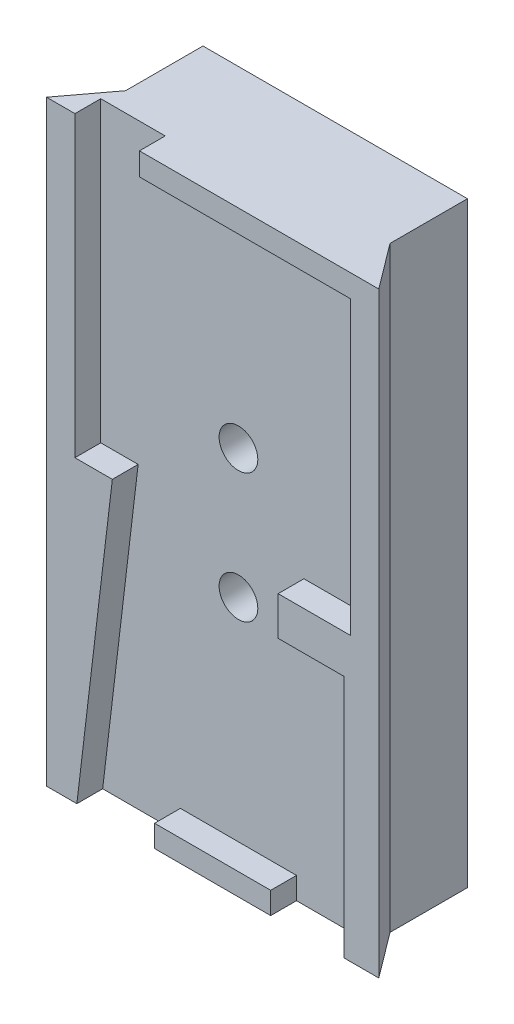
ISO-10303-21;
HEADER;
FILE_DESCRIPTION(('STEP AP214'),'2;1');
FILE_NAME('part.step','',(''),(''),'','','');
FILE_SCHEMA(('AUTOMOTIVE_DESIGN { 1 0 10303 214 1 1 1 1 }'));
ENDSEC;
DATA;
#1=APPLICATION_CONTEXT('core data for automotive mechanical design processes');
#2=APPLICATION_PROTOCOL_DEFINITION('international standard','automotive_design',2000,#1);
#3=PRODUCT_CONTEXT('',#1,'mechanical');
#4=PRODUCT('Part','Part','',(#3));
#5=PRODUCT_RELATED_PRODUCT_CATEGORY('part','',(#4));
#6=PRODUCT_DEFINITION_FORMATION('','',#4);
#7=PRODUCT_DEFINITION_CONTEXT('part definition',#1,'design');
#8=PRODUCT_DEFINITION('design','',#6,#7);
#9=PRODUCT_DEFINITION_SHAPE('','',#8);
#10=(LENGTH_UNIT() NAMED_UNIT(*) SI_UNIT(.MILLI.,.METRE.));
#11=(NAMED_UNIT(*) PLANE_ANGLE_UNIT() SI_UNIT($,.RADIAN.));
#12=(NAMED_UNIT(*) SI_UNIT($,.STERADIAN.) SOLID_ANGLE_UNIT());
#13=UNCERTAINTY_MEASURE_WITH_UNIT(LENGTH_MEASURE(1.E-05),#10,'distance_accuracy_value','');
#14=(GEOMETRIC_REPRESENTATION_CONTEXT(3) GLOBAL_UNCERTAINTY_ASSIGNED_CONTEXT((#13)) GLOBAL_UNIT_ASSIGNED_CONTEXT((#10,
#11,#12)) REPRESENTATION_CONTEXT('',''));
#15=CARTESIAN_POINT('',(0.,0.,0.));
#16=DIRECTION('',(0.,0.,1.));
#17=DIRECTION('',(1.,0.,0.));
#18=AXIS2_PLACEMENT_3D('',#15,#16,#17);
#19=CARTESIAN_POINT('',(25.75,92.5,19.));
#20=DIRECTION('',(0.,0.,-1.));
#21=DIRECTION('',(-1.,0.,0.));
#22=AXIS2_PLACEMENT_3D('',#19,#20,#21);
#23=PLANE('',#22);
#24=DIRECTION('',(1.,0.,0.));
#25=VECTOR('',#24,1.);
#26=CARTESIAN_POINT('',(25.75,0.,19.));
#27=LINE('',#26,#25);
#28=CARTESIAN_POINT('',(-25.75,0.,19.));
#29=VERTEX_POINT('',#28);
#30=CARTESIAN_POINT('',(-21.05,0.,19.));
#31=VERTEX_POINT('',#30);
#32=EDGE_CURVE('E149',#29,#31,#27,.T.);
#33=ORIENTED_EDGE('',*,*,#32,.T.);
#34=DIRECTION('',(-0.11796112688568,-0.993018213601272,0.));
#35=VECTOR('',#34,1.);
#36=CARTESIAN_POINT('',(-21.05,0.,19.));
#37=LINE('',#36,#35);
#38=CARTESIAN_POINT('',(-15.55,46.3,19.));
#39=VERTEX_POINT('',#38);
#40=EDGE_CURVE('E169',#39,#31,#37,.T.);
#41=ORIENTED_EDGE('',*,*,#40,.F.);
#42=DIRECTION('',(1.,0.,0.));
#43=VECTOR('',#42,1.);
#44=CARTESIAN_POINT('',(-15.55,46.3,19.));
#45=LINE('',#44,#43);
#46=CARTESIAN_POINT('',(-21.35,46.3,19.));
#47=VERTEX_POINT('',#46);
#48=EDGE_CURVE('E348',#47,#39,#45,.T.);
#49=ORIENTED_EDGE('',*,*,#48,.F.);
#50=DIRECTION('',(0.,-1.,0.));
#51=VECTOR('',#50,1.);
#52=CARTESIAN_POINT('',(-21.35,46.3,19.));
#53=LINE('',#52,#51);
#54=CARTESIAN_POINT('',(-21.35,92.5,19.));
#55=VERTEX_POINT('',#54);
#56=EDGE_CURVE('E133',#55,#47,#53,.T.);
#57=ORIENTED_EDGE('',*,*,#56,.F.);
#58=DIRECTION('',(1.,0.,0.));
#59=VECTOR('',#58,1.);
#60=CARTESIAN_POINT('',(25.75,92.5,19.));
#61=LINE('',#60,#59);
#62=CARTESIAN_POINT('',(-25.75,92.5,19.));
#63=VERTEX_POINT('',#62);
#64=EDGE_CURVE('E111',#63,#55,#61,.T.);
#65=ORIENTED_EDGE('',*,*,#64,.F.);
#66=DIRECTION('',(0.,-1.,0.));
#67=VECTOR('',#66,1.);
#68=CARTESIAN_POINT('',(-25.75,92.5,19.));
#69=LINE('',#68,#67);
#70=EDGE_CURVE('E120',#63,#29,#69,.T.);
#71=ORIENTED_EDGE('',*,*,#70,.T.);
#72=EDGE_LOOP('',(#33,#41,#49,#57,#65,#71));
#73=FACE_BOUND('',#72,.T.);
#74=ADVANCED_FACE('F35',(#73),#23,.F.);
#75=CARTESIAN_POINT('',(-11.35,92.5,19.));
#76=VERTEX_POINT('',#75);
#77=CARTESIAN_POINT('',(25.75,92.5,19.));
#78=VERTEX_POINT('',#77);
#79=EDGE_CURVE('E117',#76,#78,#61,.T.);
#80=ORIENTED_EDGE('',*,*,#79,.F.);
#81=DIRECTION('',(0.,1.,0.));
#82=VECTOR('',#81,1.);
#83=CARTESIAN_POINT('',(-11.35,92.5,19.));
#84=LINE('',#83,#82);
#85=CARTESIAN_POINT('',(-11.35,89.,19.));
#86=VERTEX_POINT('',#85);
#87=EDGE_CURVE('E345',#86,#76,#84,.T.);
#88=ORIENTED_EDGE('',*,*,#87,.F.);
#89=DIRECTION('',(-1.,0.,0.));
#90=VECTOR('',#89,1.);
#91=CARTESIAN_POINT('',(-11.35,89.,19.));
#92=LINE('',#91,#90);
#93=CARTESIAN_POINT('',(21.35,89.,19.));
#94=VERTEX_POINT('',#93);
#95=EDGE_CURVE('E342',#94,#86,#92,.T.);
#96=ORIENTED_EDGE('',*,*,#95,.F.);
#97=DIRECTION('',(0.,1.,0.));
#98=VECTOR('',#97,1.);
#99=CARTESIAN_POINT('',(21.35,89.,19.));
#100=LINE('',#99,#98);
#101=CARTESIAN_POINT('',(21.35,43.8,19.));
#102=VERTEX_POINT('',#101);
#103=EDGE_CURVE('E339',#102,#94,#100,.T.);
#104=ORIENTED_EDGE('',*,*,#103,.F.);
#105=DIRECTION('',(1.,0.,0.));
#106=VECTOR('',#105,1.);
#107=CARTESIAN_POINT('',(21.35,43.8,19.));
#108=LINE('',#107,#106);
#109=CARTESIAN_POINT('',(10.15,43.8,19.));
#110=VERTEX_POINT('',#109);
#111=EDGE_CURVE('E336',#110,#102,#108,.T.);
#112=ORIENTED_EDGE('',*,*,#111,.F.);
#113=DIRECTION('',(0.,1.,0.));
#114=VECTOR('',#113,1.);
#115=CARTESIAN_POINT('',(10.15,43.8,19.));
#116=LINE('',#115,#114);
#117=CARTESIAN_POINT('',(10.15,37.8,19.));
#118=VERTEX_POINT('',#117);
#119=EDGE_CURVE('E333',#118,#110,#116,.T.);
#120=ORIENTED_EDGE('',*,*,#119,.F.);
#121=DIRECTION('',(-1.,0.,0.));
#122=VECTOR('',#121,1.);
#123=CARTESIAN_POINT('',(10.15,37.8,19.));
#124=LINE('',#123,#122);
#125=CARTESIAN_POINT('',(20.35,37.8,19.));
#126=VERTEX_POINT('',#125);
#127=EDGE_CURVE('E330',#126,#118,#124,.T.);
#128=ORIENTED_EDGE('',*,*,#127,.F.);
#129=DIRECTION('',(0.,1.,0.));
#130=VECTOR('',#129,1.);
#131=CARTESIAN_POINT('',(20.35,37.8,19.));
#132=LINE('',#131,#130);
#133=CARTESIAN_POINT('',(20.35,0.,19.));
#134=VERTEX_POINT('',#133);
#135=EDGE_CURVE('E327',#134,#126,#132,.T.);
#136=ORIENTED_EDGE('',*,*,#135,.F.);
#137=CARTESIAN_POINT('',(25.75,0.,19.));
#138=VERTEX_POINT('',#137);
#139=EDGE_CURVE('E148',#134,#138,#27,.T.);
#140=ORIENTED_EDGE('',*,*,#139,.T.);
#141=DIRECTION('',(0.,-1.,0.));
#142=VECTOR('',#141,1.);
#143=CARTESIAN_POINT('',(25.75,92.5,19.));
#144=LINE('',#143,#142);
#145=EDGE_CURVE('E128',#78,#138,#144,.T.);
#146=ORIENTED_EDGE('',*,*,#145,.F.);
#147=EDGE_LOOP('',(#80,#88,#96,#104,#112,#120,#128,#136,#140,#146));
#148=FACE_BOUND('',#147,.T.);
#149=ADVANCED_FACE('F391',(#148),#23,.F.);
#150=CARTESIAN_POINT('',(20.5,92.5,0.));
#151=DIRECTION('',(-1.,0.,0.));
#152=DIRECTION('',(0.,0.,1.));
#153=AXIS2_PLACEMENT_3D('',#150,#151,#152);
#154=PLANE('',#153);
#155=DIRECTION('',(0.,0.,-1.));
#156=VECTOR('',#155,1.);
#157=CARTESIAN_POINT('',(20.5,0.,0.));
#158=LINE('',#157,#156);
#159=CARTESIAN_POINT('',(20.5,0.,12.));
#160=VERTEX_POINT('',#159);
#161=CARTESIAN_POINT('',(20.5,0.,0.));
#162=VERTEX_POINT('',#161);
#163=EDGE_CURVE('E139',#160,#162,#158,.T.);
#164=ORIENTED_EDGE('',*,*,#163,.T.);
#165=DIRECTION('',(0.,-1.,0.));
#166=VECTOR('',#165,1.);
#167=CARTESIAN_POINT('',(20.5,92.5,0.));
#168=LINE('',#167,#166);
#169=CARTESIAN_POINT('',(20.5,92.5,0.));
#170=VERTEX_POINT('',#169);
#171=EDGE_CURVE('E11',#170,#162,#168,.T.);
#172=ORIENTED_EDGE('',*,*,#171,.F.);
#173=DIRECTION('',(0.,0.,-1.));
#174=VECTOR('',#173,1.);
#175=CARTESIAN_POINT('',(20.5,92.5,0.));
#176=LINE('',#175,#174);
#177=CARTESIAN_POINT('',(20.5,92.5,12.));
#178=VERTEX_POINT('',#177);
#179=EDGE_CURVE('E153',#178,#170,#176,.T.);
#180=ORIENTED_EDGE('',*,*,#179,.F.);
#181=DIRECTION('',(0.,-1.,0.));
#182=VECTOR('',#181,1.);
#183=CARTESIAN_POINT('',(20.5,92.5,12.));
#184=LINE('',#183,#182);
#185=EDGE_CURVE('E135',#178,#160,#184,.T.);
#186=ORIENTED_EDGE('',*,*,#185,.T.);
#187=EDGE_LOOP('',(#164,#172,#180,#186));
#188=FACE_BOUND('',#187,.T.);
#189=ADVANCED_FACE('F37',(#188),#154,.F.);
#190=CARTESIAN_POINT('',(-20.5,92.5,0.));
#191=DIRECTION('',(0.,0.,1.));
#192=DIRECTION('',(1.,0.,0.));
#193=AXIS2_PLACEMENT_3D('',#190,#191,#192);
#194=PLANE('',#193);
#195=CARTESIAN_POINT('',(0.,56.25,0.));
#196=DIRECTION('',(0.,0.,1.));
#197=DIRECTION('',(1.,0.,0.));
#198=AXIS2_PLACEMENT_3D('',#195,#196,#197);
#199=CIRCLE('',#198,3.);
#200=CARTESIAN_POINT('',(3.,56.25,0.));
#201=VERTEX_POINT('',#200);
#202=EDGE_CURVE('E323',#201,#201,#199,.T.);
#203=ORIENTED_EDGE('',*,*,#202,.T.);
#204=EDGE_LOOP('',(#203));
#205=FACE_BOUND('',#204,.T.);
#206=CARTESIAN_POINT('',(0.,36.25,0.));
#207=DIRECTION('',(0.,0.,1.));
#208=DIRECTION('',(-1.,0.,0.));
#209=AXIS2_PLACEMENT_3D('',#206,#207,#208);
#210=CIRCLE('',#209,3.);
#211=CARTESIAN_POINT('',(3.,36.25,0.));
#212=VERTEX_POINT('',#211);
#213=EDGE_CURVE('E616',#212,#212,#210,.T.);
#214=ORIENTED_EDGE('',*,*,#213,.T.);
#215=EDGE_LOOP('',(#214));
#216=FACE_BOUND('',#215,.T.);
#217=DIRECTION('',(-1.,0.,0.));
#218=VECTOR('',#217,1.);
#219=CARTESIAN_POINT('',(-20.5,0.,0.));
#220=LINE('',#219,#218);
#221=CARTESIAN_POINT('',(-20.5,0.,0.));
#222=VERTEX_POINT('',#221);
#223=EDGE_CURVE('E142',#162,#222,#220,.T.);
#224=ORIENTED_EDGE('',*,*,#223,.T.);
#225=DIRECTION('',(0.,-1.,0.));
#226=VECTOR('',#225,1.);
#227=CARTESIAN_POINT('',(-20.5,92.5,0.));
#228=LINE('',#227,#226);
#229=CARTESIAN_POINT('',(-20.5,92.5,0.));
#230=VERTEX_POINT('',#229);
#231=EDGE_CURVE('E43',#230,#222,#228,.T.);
#232=ORIENTED_EDGE('',*,*,#231,.F.);
#233=DIRECTION('',(-1.,0.,0.));
#234=VECTOR('',#233,1.);
#235=CARTESIAN_POINT('',(-20.5,92.5,0.));
#236=LINE('',#235,#234);
#237=EDGE_CURVE('E94',#170,#230,#236,.T.);
#238=ORIENTED_EDGE('',*,*,#237,.F.);
#239=ORIENTED_EDGE('',*,*,#171,.T.);
#240=EDGE_LOOP('',(#224,#232,#238,#239));
#241=FACE_BOUND('',#240,.T.);
#242=ADVANCED_FACE('F383',(#205,#216,#241),#194,.F.);
#243=CARTESIAN_POINT('',(-20.5,92.5,0.));
#244=DIRECTION('',(1.,0.,0.));
#245=DIRECTION('',(0.,0.,-1.));
#246=AXIS2_PLACEMENT_3D('',#243,#244,#245);
#247=PLANE('',#246);
#248=DIRECTION('',(0.,0.,1.));
#249=VECTOR('',#248,1.);
#250=CARTESIAN_POINT('',(-20.5,0.,0.));
#251=LINE('',#250,#249);
#252=CARTESIAN_POINT('',(-20.5,0.,12.));
#253=VERTEX_POINT('',#252);
#254=EDGE_CURVE('E145',#222,#253,#251,.T.);
#255=ORIENTED_EDGE('',*,*,#254,.T.);
#256=DIRECTION('',(0.,-1.,0.));
#257=VECTOR('',#256,1.);
#258=CARTESIAN_POINT('',(-20.5,92.5,12.));
#259=LINE('',#258,#257);
#260=CARTESIAN_POINT('',(-20.5,92.5,12.));
#261=VERTEX_POINT('',#260);
#262=EDGE_CURVE('E127',#261,#253,#259,.T.);
#263=ORIENTED_EDGE('',*,*,#262,.F.);
#264=DIRECTION('',(0.,0.,1.));
#265=VECTOR('',#264,1.);
#266=CARTESIAN_POINT('',(-20.5,92.5,0.));
#267=LINE('',#266,#265);
#268=EDGE_CURVE('E113',#230,#261,#267,.T.);
#269=ORIENTED_EDGE('',*,*,#268,.F.);
#270=ORIENTED_EDGE('',*,*,#231,.T.);
#271=EDGE_LOOP('',(#255,#263,#269,#270));
#272=FACE_BOUND('',#271,.T.);
#273=ADVANCED_FACE('F159',(#272),#247,.F.);
#274=CARTESIAN_POINT('',(-20.5,92.5,12.));
#275=DIRECTION('',(0.8,0.,0.6));
#276=DIRECTION('',(0.6,0.,-0.8));
#277=AXIS2_PLACEMENT_3D('',#274,#275,#276);
#278=PLANE('',#277);
#279=DIRECTION('',(-0.6,0.,0.8));
#280=VECTOR('',#279,1.);
#281=CARTESIAN_POINT('',(-20.5,0.,12.));
#282=LINE('',#281,#280);
#283=EDGE_CURVE('E123',#253,#29,#282,.T.);
#284=ORIENTED_EDGE('',*,*,#283,.T.);
#285=ORIENTED_EDGE('',*,*,#70,.F.);
#286=DIRECTION('',(-0.6,0.,0.8));
#287=VECTOR('',#286,1.);
#288=CARTESIAN_POINT('',(-20.5,92.5,12.));
#289=LINE('',#288,#287);
#290=EDGE_CURVE('E105',#261,#63,#289,.T.);
#291=ORIENTED_EDGE('',*,*,#290,.F.);
#292=ORIENTED_EDGE('',*,*,#262,.T.);
#293=EDGE_LOOP('',(#284,#285,#291,#292));
#294=FACE_BOUND('',#293,.T.);
#295=ADVANCED_FACE('F121',(#294),#278,.F.);
#296=CARTESIAN_POINT('',(-9.,0.,19.));
#297=VERTEX_POINT('',#296);
#298=CARTESIAN_POINT('',(9.,0.,19.));
#299=VERTEX_POINT('',#298);
#300=EDGE_CURVE('E151',#297,#299,#27,.T.);
#301=ORIENTED_EDGE('',*,*,#300,.T.);
#302=DIRECTION('',(0.,-1.,0.));
#303=VECTOR('',#302,1.);
#304=CARTESIAN_POINT('',(9.,0.,19.));
#305=LINE('',#304,#303);
#306=CARTESIAN_POINT('',(9.,3.4,19.));
#307=VERTEX_POINT('',#306);
#308=EDGE_CURVE('E325',#307,#299,#305,.T.);
#309=ORIENTED_EDGE('',*,*,#308,.F.);
#310=DIRECTION('',(1.,0.,0.));
#311=VECTOR('',#310,1.);
#312=CARTESIAN_POINT('',(9.,3.4,19.));
#313=LINE('',#312,#311);
#314=CARTESIAN_POINT('',(-9.,3.4,19.));
#315=VERTEX_POINT('',#314);
#316=EDGE_CURVE('E322',#315,#307,#313,.T.);
#317=ORIENTED_EDGE('',*,*,#316,.F.);
#318=DIRECTION('',(0.,1.,0.));
#319=VECTOR('',#318,1.);
#320=CARTESIAN_POINT('',(-9.,3.4,19.));
#321=LINE('',#320,#319);
#322=EDGE_CURVE('E268',#297,#315,#321,.T.);
#323=ORIENTED_EDGE('',*,*,#322,.F.);
#324=EDGE_LOOP('',(#301,#309,#317,#323));
#325=FACE_BOUND('',#324,.T.);
#326=ADVANCED_FACE('F396',(#325),#23,.F.);
#327=CARTESIAN_POINT('',(20.5,92.5,12.));
#328=DIRECTION('',(-0.8,0.,0.6));
#329=DIRECTION('',(0.600000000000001,0.,0.8));
#330=AXIS2_PLACEMENT_3D('',#327,#328,#329);
#331=PLANE('',#330);
#332=DIRECTION('',(-0.6,0.,-0.8));
#333=VECTOR('',#332,1.);
#334=CARTESIAN_POINT('',(20.5,0.,12.));
#335=LINE('',#334,#333);
#336=EDGE_CURVE('E86',#138,#160,#335,.T.);
#337=ORIENTED_EDGE('',*,*,#336,.T.);
#338=ORIENTED_EDGE('',*,*,#185,.F.);
#339=DIRECTION('',(-0.6,0.,-0.8));
#340=VECTOR('',#339,1.);
#341=CARTESIAN_POINT('',(20.5,92.5,12.));
#342=LINE('',#341,#340);
#343=EDGE_CURVE('E59',#78,#178,#342,.T.);
#344=ORIENTED_EDGE('',*,*,#343,.F.);
#345=ORIENTED_EDGE('',*,*,#145,.T.);
#346=EDGE_LOOP('',(#337,#338,#344,#345));
#347=FACE_BOUND('',#346,.T.);
#348=ADVANCED_FACE('F404',(#347),#331,.F.);
#349=CARTESIAN_POINT('',(0.,92.5,0.));
#350=DIRECTION('',(0.,-1.,0.));
#351=DIRECTION('',(0.,0.,-1.));
#352=AXIS2_PLACEMENT_3D('',#349,#350,#351);
#353=PLANE('',#352);
#354=ORIENTED_EDGE('',*,*,#64,.T.);
#355=DIRECTION('',(0.,0.,1.));
#356=VECTOR('',#355,1.);
#357=CARTESIAN_POINT('',(-21.35,92.5,15.));
#358=LINE('',#357,#356);
#359=CARTESIAN_POINT('',(-21.35,92.5,15.));
#360=VERTEX_POINT('',#359);
#361=EDGE_CURVE('E355',#360,#55,#358,.T.);
#362=ORIENTED_EDGE('',*,*,#361,.F.);
#363=DIRECTION('',(-1.,0.,0.));
#364=VECTOR('',#363,1.);
#365=CARTESIAN_POINT('',(-21.35,92.5,15.));
#366=LINE('',#365,#364);
#367=CARTESIAN_POINT('',(-11.35,92.5,15.));
#368=VERTEX_POINT('',#367);
#369=EDGE_CURVE('E310',#368,#360,#366,.T.);
#370=ORIENTED_EDGE('',*,*,#369,.F.);
#371=DIRECTION('',(0.,0.,1.));
#372=VECTOR('',#371,1.);
#373=CARTESIAN_POINT('',(-11.35,92.5,15.));
#374=LINE('',#373,#372);
#375=EDGE_CURVE('E357',#368,#76,#374,.T.);
#376=ORIENTED_EDGE('',*,*,#375,.T.);
#377=ORIENTED_EDGE('',*,*,#79,.T.);
#378=ORIENTED_EDGE('',*,*,#343,.T.);
#379=ORIENTED_EDGE('',*,*,#179,.T.);
#380=ORIENTED_EDGE('',*,*,#237,.T.);
#381=ORIENTED_EDGE('',*,*,#268,.T.);
#382=ORIENTED_EDGE('',*,*,#290,.T.);
#383=EDGE_LOOP('',(#354,#362,#370,#376,#377,#378,#379,#380,#381,#382));
#384=FACE_BOUND('',#383,.T.);
#385=ADVANCED_FACE('F107',(#384),#353,.F.);
#386=CARTESIAN_POINT('',(0.,0.,0.));
#387=DIRECTION('',(0.,-1.,0.));
#388=DIRECTION('',(0.,0.,-1.));
#389=AXIS2_PLACEMENT_3D('',#386,#387,#388);
#390=PLANE('',#389);
#391=DIRECTION('',(0.,0.,1.));
#392=VECTOR('',#391,1.);
#393=CARTESIAN_POINT('',(-21.05,0.,15.));
#394=LINE('',#393,#392);
#395=CARTESIAN_POINT('',(-21.05,0.,15.));
#396=VERTEX_POINT('',#395);
#397=EDGE_CURVE('E143',#396,#31,#394,.T.);
#398=ORIENTED_EDGE('',*,*,#397,.T.);
#399=ORIENTED_EDGE('',*,*,#32,.F.);
#400=ORIENTED_EDGE('',*,*,#283,.F.);
#401=ORIENTED_EDGE('',*,*,#254,.F.);
#402=ORIENTED_EDGE('',*,*,#223,.F.);
#403=ORIENTED_EDGE('',*,*,#163,.F.);
#404=ORIENTED_EDGE('',*,*,#336,.F.);
#405=ORIENTED_EDGE('',*,*,#139,.F.);
#406=DIRECTION('',(0.,0.,1.));
#407=VECTOR('',#406,1.);
#408=CARTESIAN_POINT('',(20.35,0.,15.));
#409=LINE('',#408,#407);
#410=CARTESIAN_POINT('',(20.35,0.,15.));
#411=VERTEX_POINT('',#410);
#412=EDGE_CURVE('E372',#411,#134,#409,.T.);
#413=ORIENTED_EDGE('',*,*,#412,.F.);
#414=DIRECTION('',(1.,0.,0.));
#415=VECTOR('',#414,1.);
#416=CARTESIAN_POINT('',(20.35,0.,15.));
#417=LINE('',#416,#415);
#418=CARTESIAN_POINT('',(9.,0.,15.));
#419=VERTEX_POINT('',#418);
#420=EDGE_CURVE('E287',#419,#411,#417,.T.);
#421=ORIENTED_EDGE('',*,*,#420,.F.);
#422=DIRECTION('',(0.,0.,1.));
#423=VECTOR('',#422,1.);
#424=CARTESIAN_POINT('',(9.,0.,15.));
#425=LINE('',#424,#423);
#426=EDGE_CURVE('E374',#419,#299,#425,.T.);
#427=ORIENTED_EDGE('',*,*,#426,.T.);
#428=ORIENTED_EDGE('',*,*,#300,.F.);
#429=DIRECTION('',(0.,0.,1.));
#430=VECTOR('',#429,1.);
#431=CARTESIAN_POINT('',(-9.,0.,15.));
#432=LINE('',#431,#430);
#433=CARTESIAN_POINT('',(-9.,0.,15.));
#434=VERTEX_POINT('',#433);
#435=EDGE_CURVE('E273',#434,#297,#432,.T.);
#436=ORIENTED_EDGE('',*,*,#435,.F.);
#437=DIRECTION('',(1.,0.,0.));
#438=VECTOR('',#437,1.);
#439=CARTESIAN_POINT('',(-9.,0.,15.));
#440=LINE('',#439,#438);
#441=EDGE_CURVE('E280',#396,#434,#440,.T.);
#442=ORIENTED_EDGE('',*,*,#441,.F.);
#443=EDGE_LOOP('',(#398,#399,#400,#401,#402,#403,#404,#405,#413,#421,#427,#428,#436,#442));
#444=FACE_BOUND('',#443,.T.);
#445=ADVANCED_FACE('F162',(#444),#390,.T.);
#446=CARTESIAN_POINT('',(-21.05,0.,15.));
#447=DIRECTION('',(-0.993018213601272,0.11796112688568,0.));
#448=DIRECTION('',(-0.11796112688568,-0.993018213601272,0.));
#449=AXIS2_PLACEMENT_3D('',#446,#447,#448);
#450=PLANE('',#449);
#451=ORIENTED_EDGE('',*,*,#40,.T.);
#452=ORIENTED_EDGE('',*,*,#397,.F.);
#453=DIRECTION('',(-0.11796112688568,-0.993018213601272,0.));
#454=VECTOR('',#453,1.);
#455=CARTESIAN_POINT('',(-21.05,0.,15.));
#456=LINE('',#455,#454);
#457=CARTESIAN_POINT('',(-15.55,46.3,15.));
#458=VERTEX_POINT('',#457);
#459=EDGE_CURVE('E319',#458,#396,#456,.T.);
#460=ORIENTED_EDGE('',*,*,#459,.F.);
#461=DIRECTION('',(0.,0.,1.));
#462=VECTOR('',#461,1.);
#463=CARTESIAN_POINT('',(-15.55,46.3,15.));
#464=LINE('',#463,#462);
#465=EDGE_CURVE('E179',#458,#39,#464,.T.);
#466=ORIENTED_EDGE('',*,*,#465,.T.);
#467=EDGE_LOOP('',(#451,#452,#460,#466));
#468=FACE_BOUND('',#467,.T.);
#469=ADVANCED_FACE('F450',(#468),#450,.F.);
#470=CARTESIAN_POINT('',(-15.55,46.3,15.));
#471=DIRECTION('',(0.,-1.,0.));
#472=DIRECTION('',(0.,0.,-1.));
#473=AXIS2_PLACEMENT_3D('',#470,#471,#472);
#474=PLANE('',#473);
#475=ORIENTED_EDGE('',*,*,#48,.T.);
#476=ORIENTED_EDGE('',*,*,#465,.F.);
#477=DIRECTION('',(1.,0.,0.));
#478=VECTOR('',#477,1.);
#479=CARTESIAN_POINT('',(-15.55,46.3,15.));
#480=LINE('',#479,#478);
#481=CARTESIAN_POINT('',(-21.35,46.3,15.));
#482=VERTEX_POINT('',#481);
#483=EDGE_CURVE('E316',#482,#458,#480,.T.);
#484=ORIENTED_EDGE('',*,*,#483,.F.);
#485=DIRECTION('',(0.,0.,1.));
#486=VECTOR('',#485,1.);
#487=CARTESIAN_POINT('',(-21.35,46.3,15.));
#488=LINE('',#487,#486);
#489=EDGE_CURVE('E353',#482,#47,#488,.T.);
#490=ORIENTED_EDGE('',*,*,#489,.T.);
#491=EDGE_LOOP('',(#475,#476,#484,#490));
#492=FACE_BOUND('',#491,.T.);
#493=ADVANCED_FACE('F452',(#492),#474,.F.);
#494=CARTESIAN_POINT('',(-21.35,46.3,15.));
#495=DIRECTION('',(-1.,0.,0.));
#496=DIRECTION('',(0.,0.,1.));
#497=AXIS2_PLACEMENT_3D('',#494,#495,#496);
#498=PLANE('',#497);
#499=ORIENTED_EDGE('',*,*,#56,.T.);
#500=ORIENTED_EDGE('',*,*,#489,.F.);
#501=DIRECTION('',(0.,-1.,0.));
#502=VECTOR('',#501,1.);
#503=CARTESIAN_POINT('',(-21.35,46.3,15.));
#504=LINE('',#503,#502);
#505=EDGE_CURVE('E313',#360,#482,#504,.T.);
#506=ORIENTED_EDGE('',*,*,#505,.F.);
#507=ORIENTED_EDGE('',*,*,#361,.T.);
#508=EDGE_LOOP('',(#499,#500,#506,#507));
#509=FACE_BOUND('',#508,.T.);
#510=ADVANCED_FACE('F447',(#509),#498,.F.);
#511=CARTESIAN_POINT('',(-11.35,92.5,15.));
#512=DIRECTION('',(1.,0.,0.));
#513=DIRECTION('',(0.,0.,-1.));
#514=AXIS2_PLACEMENT_3D('',#511,#512,#513);
#515=PLANE('',#514);
#516=ORIENTED_EDGE('',*,*,#87,.T.);
#517=ORIENTED_EDGE('',*,*,#375,.F.);
#518=DIRECTION('',(0.,1.,0.));
#519=VECTOR('',#518,1.);
#520=CARTESIAN_POINT('',(-11.35,92.5,15.));
#521=LINE('',#520,#519);
#522=CARTESIAN_POINT('',(-11.35,89.,15.));
#523=VERTEX_POINT('',#522);
#524=EDGE_CURVE('E307',#523,#368,#521,.T.);
#525=ORIENTED_EDGE('',*,*,#524,.F.);
#526=DIRECTION('',(0.,0.,1.));
#527=VECTOR('',#526,1.);
#528=CARTESIAN_POINT('',(-11.35,89.,15.));
#529=LINE('',#528,#527);
#530=EDGE_CURVE('E360',#523,#86,#529,.T.);
#531=ORIENTED_EDGE('',*,*,#530,.T.);
#532=EDGE_LOOP('',(#516,#517,#525,#531));
#533=FACE_BOUND('',#532,.T.);
#534=ADVANCED_FACE('F444',(#533),#515,.F.);
#535=CARTESIAN_POINT('',(-11.35,89.,15.));
#536=DIRECTION('',(0.,1.,0.));
#537=DIRECTION('',(0.,0.,1.));
#538=AXIS2_PLACEMENT_3D('',#535,#536,#537);
#539=PLANE('',#538);
#540=ORIENTED_EDGE('',*,*,#95,.T.);
#541=ORIENTED_EDGE('',*,*,#530,.F.);
#542=DIRECTION('',(-1.,0.,0.));
#543=VECTOR('',#542,1.);
#544=CARTESIAN_POINT('',(-11.35,89.,15.));
#545=LINE('',#544,#543);
#546=CARTESIAN_POINT('',(21.35,89.,15.));
#547=VERTEX_POINT('',#546);
#548=EDGE_CURVE('E304',#547,#523,#545,.T.);
#549=ORIENTED_EDGE('',*,*,#548,.F.);
#550=DIRECTION('',(0.,0.,1.));
#551=VECTOR('',#550,1.);
#552=CARTESIAN_POINT('',(21.35,89.,15.));
#553=LINE('',#552,#551);
#554=EDGE_CURVE('E362',#547,#94,#553,.T.);
#555=ORIENTED_EDGE('',*,*,#554,.T.);
#556=EDGE_LOOP('',(#540,#541,#549,#555));
#557=FACE_BOUND('',#556,.T.);
#558=ADVANCED_FACE('F440',(#557),#539,.F.);
#559=CARTESIAN_POINT('',(21.35,89.,15.));
#560=DIRECTION('',(1.,0.,0.));
#561=DIRECTION('',(0.,1.,0.));
#562=AXIS2_PLACEMENT_3D('',#559,#560,#561);
#563=PLANE('',#562);
#564=ORIENTED_EDGE('',*,*,#103,.T.);
#565=ORIENTED_EDGE('',*,*,#554,.F.);
#566=DIRECTION('',(0.,1.,0.));
#567=VECTOR('',#566,1.);
#568=CARTESIAN_POINT('',(21.35,89.,15.));
#569=LINE('',#568,#567);
#570=CARTESIAN_POINT('',(21.35,43.8,15.));
#571=VERTEX_POINT('',#570);
#572=EDGE_CURVE('E301',#571,#547,#569,.T.);
#573=ORIENTED_EDGE('',*,*,#572,.F.);
#574=DIRECTION('',(0.,0.,1.));
#575=VECTOR('',#574,1.);
#576=CARTESIAN_POINT('',(21.35,43.8,15.));
#577=LINE('',#576,#575);
#578=EDGE_CURVE('E364',#571,#102,#577,.T.);
#579=ORIENTED_EDGE('',*,*,#578,.T.);
#580=EDGE_LOOP('',(#564,#565,#573,#579));
#581=FACE_BOUND('',#580,.T.);
#582=ADVANCED_FACE('F436',(#581),#563,.F.);
#583=CARTESIAN_POINT('',(21.35,43.8,15.));
#584=DIRECTION('',(0.,-1.,0.));
#585=DIRECTION('',(0.,0.,-1.));
#586=AXIS2_PLACEMENT_3D('',#583,#584,#585);
#587=PLANE('',#586);
#588=ORIENTED_EDGE('',*,*,#111,.T.);
#589=ORIENTED_EDGE('',*,*,#578,.F.);
#590=DIRECTION('',(1.,0.,0.));
#591=VECTOR('',#590,1.);
#592=CARTESIAN_POINT('',(21.35,43.8,15.));
#593=LINE('',#592,#591);
#594=CARTESIAN_POINT('',(10.15,43.8,15.));
#595=VERTEX_POINT('',#594);
#596=EDGE_CURVE('E298',#595,#571,#593,.T.);
#597=ORIENTED_EDGE('',*,*,#596,.F.);
#598=DIRECTION('',(0.,0.,1.));
#599=VECTOR('',#598,1.);
#600=CARTESIAN_POINT('',(10.15,43.8,15.));
#601=LINE('',#600,#599);
#602=EDGE_CURVE('E366',#595,#110,#601,.T.);
#603=ORIENTED_EDGE('',*,*,#602,.T.);
#604=EDGE_LOOP('',(#588,#589,#597,#603));
#605=FACE_BOUND('',#604,.T.);
#606=ADVANCED_FACE('F432',(#605),#587,.F.);
#607=CARTESIAN_POINT('',(10.15,43.8,15.));
#608=DIRECTION('',(1.,0.,0.));
#609=DIRECTION('',(0.,0.,-1.));
#610=AXIS2_PLACEMENT_3D('',#607,#608,#609);
#611=PLANE('',#610);
#612=ORIENTED_EDGE('',*,*,#119,.T.);
#613=ORIENTED_EDGE('',*,*,#602,.F.);
#614=DIRECTION('',(0.,1.,0.));
#615=VECTOR('',#614,1.);
#616=CARTESIAN_POINT('',(10.15,43.8,15.));
#617=LINE('',#616,#615);
#618=CARTESIAN_POINT('',(10.15,37.8,15.));
#619=VERTEX_POINT('',#618);
#620=EDGE_CURVE('E295',#619,#595,#617,.T.);
#621=ORIENTED_EDGE('',*,*,#620,.F.);
#622=DIRECTION('',(0.,0.,1.));
#623=VECTOR('',#622,1.);
#624=CARTESIAN_POINT('',(10.15,37.8,15.));
#625=LINE('',#624,#623);
#626=EDGE_CURVE('E368',#619,#118,#625,.T.);
#627=ORIENTED_EDGE('',*,*,#626,.T.);
#628=EDGE_LOOP('',(#612,#613,#621,#627));
#629=FACE_BOUND('',#628,.T.);
#630=ADVANCED_FACE('F428',(#629),#611,.F.);
#631=CARTESIAN_POINT('',(10.15,37.8,15.));
#632=DIRECTION('',(0.,1.,0.));
#633=DIRECTION('',(0.,0.,1.));
#634=AXIS2_PLACEMENT_3D('',#631,#632,#633);
#635=PLANE('',#634);
#636=ORIENTED_EDGE('',*,*,#127,.T.);
#637=ORIENTED_EDGE('',*,*,#626,.F.);
#638=DIRECTION('',(-1.,0.,0.));
#639=VECTOR('',#638,1.);
#640=CARTESIAN_POINT('',(10.15,37.8,15.));
#641=LINE('',#640,#639);
#642=CARTESIAN_POINT('',(20.35,37.8,15.));
#643=VERTEX_POINT('',#642);
#644=EDGE_CURVE('E292',#643,#619,#641,.T.);
#645=ORIENTED_EDGE('',*,*,#644,.F.);
#646=DIRECTION('',(0.,0.,1.));
#647=VECTOR('',#646,1.);
#648=CARTESIAN_POINT('',(20.35,37.8,15.));
#649=LINE('',#648,#647);
#650=EDGE_CURVE('E370',#643,#126,#649,.T.);
#651=ORIENTED_EDGE('',*,*,#650,.T.);
#652=EDGE_LOOP('',(#636,#637,#645,#651));
#653=FACE_BOUND('',#652,.T.);
#654=ADVANCED_FACE('F425',(#653),#635,.F.);
#655=CARTESIAN_POINT('',(20.35,37.8,15.));
#656=DIRECTION('',(1.,0.,0.));
#657=DIRECTION('',(0.,1.,0.));
#658=AXIS2_PLACEMENT_3D('',#655,#656,#657);
#659=PLANE('',#658);
#660=ORIENTED_EDGE('',*,*,#135,.T.);
#661=ORIENTED_EDGE('',*,*,#650,.F.);
#662=DIRECTION('',(0.,1.,0.));
#663=VECTOR('',#662,1.);
#664=CARTESIAN_POINT('',(20.35,37.8,15.));
#665=LINE('',#664,#663);
#666=EDGE_CURVE('E289',#411,#643,#665,.T.);
#667=ORIENTED_EDGE('',*,*,#666,.F.);
#668=ORIENTED_EDGE('',*,*,#412,.T.);
#669=EDGE_LOOP('',(#660,#661,#667,#668));
#670=FACE_BOUND('',#669,.T.);
#671=ADVANCED_FACE('F421',(#670),#659,.F.);
#672=CARTESIAN_POINT('',(9.,0.,15.));
#673=DIRECTION('',(-1.,0.,0.));
#674=DIRECTION('',(0.,0.,1.));
#675=AXIS2_PLACEMENT_3D('',#672,#673,#674);
#676=PLANE('',#675);
#677=ORIENTED_EDGE('',*,*,#308,.T.);
#678=ORIENTED_EDGE('',*,*,#426,.F.);
#679=DIRECTION('',(0.,-1.,0.));
#680=VECTOR('',#679,1.);
#681=CARTESIAN_POINT('',(9.,0.,15.));
#682=LINE('',#681,#680);
#683=CARTESIAN_POINT('',(9.,3.4,15.));
#684=VERTEX_POINT('',#683);
#685=EDGE_CURVE('E50',#684,#419,#682,.T.);
#686=ORIENTED_EDGE('',*,*,#685,.F.);
#687=DIRECTION('',(0.,0.,1.));
#688=VECTOR('',#687,1.);
#689=CARTESIAN_POINT('',(9.,3.4,15.));
#690=LINE('',#689,#688);
#691=EDGE_CURVE('E272',#684,#307,#690,.T.);
#692=ORIENTED_EDGE('',*,*,#691,.T.);
#693=EDGE_LOOP('',(#677,#678,#686,#692));
#694=FACE_BOUND('',#693,.T.);
#695=ADVANCED_FACE('F479',(#694),#676,.F.);
#696=CARTESIAN_POINT('',(9.,3.4,15.));
#697=DIRECTION('',(0.,-1.,0.));
#698=DIRECTION('',(1.,0.,0.));
#699=AXIS2_PLACEMENT_3D('',#696,#697,#698);
#700=PLANE('',#699);
#701=ORIENTED_EDGE('',*,*,#316,.T.);
#702=ORIENTED_EDGE('',*,*,#691,.F.);
#703=DIRECTION('',(1.,0.,0.));
#704=VECTOR('',#703,1.);
#705=CARTESIAN_POINT('',(9.,3.4,15.));
#706=LINE('',#705,#704);
#707=CARTESIAN_POINT('',(-9.,3.4,15.));
#708=VERTEX_POINT('',#707);
#709=EDGE_CURVE('E275',#708,#684,#706,.T.);
#710=ORIENTED_EDGE('',*,*,#709,.F.);
#711=DIRECTION('',(0.,0.,1.));
#712=VECTOR('',#711,1.);
#713=CARTESIAN_POINT('',(-9.,3.4,15.));
#714=LINE('',#713,#712);
#715=EDGE_CURVE('E261',#708,#315,#714,.T.);
#716=ORIENTED_EDGE('',*,*,#715,.T.);
#717=EDGE_LOOP('',(#701,#702,#710,#716));
#718=FACE_BOUND('',#717,.T.);
#719=ADVANCED_FACE('F276',(#718),#700,.F.);
#720=CARTESIAN_POINT('',(-9.,3.4,15.));
#721=DIRECTION('',(1.,0.,0.));
#722=DIRECTION('',(0.,0.,-1.));
#723=AXIS2_PLACEMENT_3D('',#720,#721,#722);
#724=PLANE('',#723);
#725=ORIENTED_EDGE('',*,*,#322,.T.);
#726=ORIENTED_EDGE('',*,*,#715,.F.);
#727=DIRECTION('',(0.,1.,0.));
#728=VECTOR('',#727,1.);
#729=CARTESIAN_POINT('',(-9.,3.4,15.));
#730=LINE('',#729,#728);
#731=EDGE_CURVE('E265',#434,#708,#730,.T.);
#732=ORIENTED_EDGE('',*,*,#731,.F.);
#733=ORIENTED_EDGE('',*,*,#435,.T.);
#734=EDGE_LOOP('',(#725,#726,#732,#733));
#735=FACE_BOUND('',#734,.T.);
#736=ADVANCED_FACE('F263',(#735),#724,.F.);
#737=CARTESIAN_POINT('',(0.,0.,15.));
#738=DIRECTION('',(0.,0.,-1.));
#739=DIRECTION('',(-1.,0.,0.));
#740=AXIS2_PLACEMENT_3D('',#737,#738,#739);
#741=PLANE('',#740);
#742=CARTESIAN_POINT('',(0.,56.25,15.));
#743=DIRECTION('',(0.,0.,1.));
#744=DIRECTION('',(1.,0.,0.));
#745=AXIS2_PLACEMENT_3D('',#742,#743,#744);
#746=CIRCLE('',#745,3.);
#747=CARTESIAN_POINT('',(3.,56.25,15.));
#748=VERTEX_POINT('',#747);
#749=EDGE_CURVE('E615',#748,#748,#746,.T.);
#750=ORIENTED_EDGE('',*,*,#749,.F.);
#751=EDGE_LOOP('',(#750));
#752=FACE_BOUND('',#751,.T.);
#753=CARTESIAN_POINT('',(0.,36.25,15.));
#754=DIRECTION('',(0.,0.,1.));
#755=DIRECTION('',(-1.,0.,0.));
#756=AXIS2_PLACEMENT_3D('',#753,#754,#755);
#757=CIRCLE('',#756,3.);
#758=CARTESIAN_POINT('',(3.,36.25,15.));
#759=VERTEX_POINT('',#758);
#760=EDGE_CURVE('E620',#759,#759,#757,.T.);
#761=ORIENTED_EDGE('',*,*,#760,.F.);
#762=EDGE_LOOP('',(#761));
#763=FACE_BOUND('',#762,.T.);
#764=ORIENTED_EDGE('',*,*,#441,.T.);
#765=ORIENTED_EDGE('',*,*,#731,.T.);
#766=ORIENTED_EDGE('',*,*,#709,.T.);
#767=ORIENTED_EDGE('',*,*,#685,.T.);
#768=ORIENTED_EDGE('',*,*,#420,.T.);
#769=ORIENTED_EDGE('',*,*,#666,.T.);
#770=ORIENTED_EDGE('',*,*,#644,.T.);
#771=ORIENTED_EDGE('',*,*,#620,.T.);
#772=ORIENTED_EDGE('',*,*,#596,.T.);
#773=ORIENTED_EDGE('',*,*,#572,.T.);
#774=ORIENTED_EDGE('',*,*,#548,.T.);
#775=ORIENTED_EDGE('',*,*,#524,.T.);
#776=ORIENTED_EDGE('',*,*,#369,.T.);
#777=ORIENTED_EDGE('',*,*,#505,.T.);
#778=ORIENTED_EDGE('',*,*,#483,.T.);
#779=ORIENTED_EDGE('',*,*,#459,.T.);
#780=EDGE_LOOP('',(#764,#765,#766,#767,#768,#769,#770,#771,#772,#773,#774,#775,#776,#777,#778,#779));
#781=FACE_BOUND('',#780,.T.);
#782=ADVANCED_FACE('F278',(#752,#763,#781),#741,.F.);
#783=CARTESIAN_POINT('',(0.,36.25,0.));
#784=DIRECTION('',(0.,0.,1.));
#785=DIRECTION('',(1.,0.,0.));
#786=AXIS2_PLACEMENT_3D('',#783,#784,#785);
#787=CYLINDRICAL_SURFACE('',#786,3.);
#788=CARTESIAN_POINT('',(3.,36.25,0.));
#789=CARTESIAN_POINT('',(3.,36.25,0.156249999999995));
#790=CARTESIAN_POINT('',(3.,36.25,0.312499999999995));
#791=CARTESIAN_POINT('',(3.,36.25,0.624999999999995));
#792=CARTESIAN_POINT('',(3.,36.25,0.781249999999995));
#793=CARTESIAN_POINT('',(3.,36.25,1.09374999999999));
#794=CARTESIAN_POINT('',(3.,36.25,1.24999999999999));
#795=CARTESIAN_POINT('',(3.,36.25,1.56249999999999));
#796=CARTESIAN_POINT('',(3.,36.25,1.71874999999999));
#797=CARTESIAN_POINT('',(3.,36.25,2.03124999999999));
#798=CARTESIAN_POINT('',(3.,36.25,2.18749999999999));
#799=CARTESIAN_POINT('',(3.,36.25,2.49999999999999));
#800=CARTESIAN_POINT('',(3.,36.25,2.65624999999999));
#801=CARTESIAN_POINT('',(3.,36.25,2.96874999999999));
#802=CARTESIAN_POINT('',(3.,36.25,3.12499999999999));
#803=CARTESIAN_POINT('',(3.,36.25,3.43749999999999));
#804=CARTESIAN_POINT('',(3.,36.25,3.59374999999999));
#805=CARTESIAN_POINT('',(3.,36.25,3.90624999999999));
#806=CARTESIAN_POINT('',(3.,36.25,4.06249999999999));
#807=CARTESIAN_POINT('',(3.,36.25,4.37499999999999));
#808=CARTESIAN_POINT('',(3.,36.25,4.53124999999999));
#809=CARTESIAN_POINT('',(3.,36.25,4.84374999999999));
#810=CARTESIAN_POINT('',(3.,36.25,4.99999999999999));
#811=CARTESIAN_POINT('',(3.,36.25,5.31249999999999));
#812=CARTESIAN_POINT('',(3.,36.25,5.46874999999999));
#813=CARTESIAN_POINT('',(3.,36.25,5.78124999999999));
#814=CARTESIAN_POINT('',(3.,36.25,5.93749999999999));
#815=CARTESIAN_POINT('',(3.,36.25,6.24999999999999));
#816=CARTESIAN_POINT('',(3.,36.25,6.40624999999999));
#817=CARTESIAN_POINT('',(3.,36.25,6.71874999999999));
#818=CARTESIAN_POINT('',(3.,36.25,6.87499999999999));
#819=CARTESIAN_POINT('',(3.,36.25,7.18749999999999));
#820=CARTESIAN_POINT('',(3.,36.25,7.34374999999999));
#821=CARTESIAN_POINT('',(3.,36.25,7.65624999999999));
#822=CARTESIAN_POINT('',(3.,36.25,7.81249999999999));
#823=CARTESIAN_POINT('',(3.,36.25,8.12499999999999));
#824=CARTESIAN_POINT('',(3.,36.25,8.28124999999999));
#825=CARTESIAN_POINT('',(3.,36.25,8.59374999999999));
#826=CARTESIAN_POINT('',(3.,36.25,8.74999999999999));
#827=CARTESIAN_POINT('',(3.,36.25,9.06249999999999));
#828=CARTESIAN_POINT('',(3.,36.25,9.21874999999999));
#829=CARTESIAN_POINT('',(3.,36.25,9.53124999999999));
#830=CARTESIAN_POINT('',(3.,36.25,9.68749999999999));
#831=CARTESIAN_POINT('',(3.,36.25,9.99999999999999));
#832=CARTESIAN_POINT('',(3.,36.25,10.15625));
#833=CARTESIAN_POINT('',(3.,36.25,10.46875));
#834=CARTESIAN_POINT('',(3.,36.25,10.625));
#835=CARTESIAN_POINT('',(3.,36.25,10.9375));
#836=CARTESIAN_POINT('',(3.,36.25,11.09375));
#837=CARTESIAN_POINT('',(3.,36.25,11.40625));
#838=CARTESIAN_POINT('',(3.,36.25,11.5625));
#839=CARTESIAN_POINT('',(3.,36.25,11.875));
#840=CARTESIAN_POINT('',(3.,36.25,12.03125));
#841=CARTESIAN_POINT('',(3.,36.25,12.34375));
#842=CARTESIAN_POINT('',(3.,36.25,12.5));
#843=CARTESIAN_POINT('',(3.,36.25,12.8125));
#844=CARTESIAN_POINT('',(3.,36.25,12.96875));
#845=CARTESIAN_POINT('',(3.,36.25,13.28125));
#846=CARTESIAN_POINT('',(3.,36.25,13.4375));
#847=CARTESIAN_POINT('',(3.,36.25,13.75));
#848=CARTESIAN_POINT('',(3.,36.25,13.90625));
#849=CARTESIAN_POINT('',(3.,36.25,14.21875));
#850=CARTESIAN_POINT('',(3.,36.25,14.375));
#851=CARTESIAN_POINT('',(3.,36.25,14.6875));
#852=CARTESIAN_POINT('',(3.,36.25,14.84375));
#853=CARTESIAN_POINT('',(3.,36.25,15.));
#854=B_SPLINE_CURVE_WITH_KNOTS('',3,(#788,#789,#790,#791,#792,#793,#794,#795,#796,#797,#798,
#799,#800,#801,#802,#803,#804,#805,#806,#807,#808,#809,#810,#811,#812,#813,#814,#815,#816,#817,
#818,#819,#820,#821,#822,#823,#824,#825,#826,#827,#828,#829,#830,#831,#832,#833,#834,#835,#836,
#837,#838,#839,#840,#841,#842,#843,#844,#845,#846,#847,#848,#849,#850,#851,#852,#853),
.UNSPECIFIED.,.F.,.F.,(4,2,2,2,2,2,2,2,2,2,2,2,2,2,2,2,2,2,2,2,2,2,2,2,2,2,2,2,2,2,2,2,4),(0.,
0.46875,0.9375,1.40625,1.875,2.34375,2.8125,3.28125,3.75,4.21875,4.6875,5.15625,5.625,6.09375,
6.5625,7.03125,7.5,7.96875,8.4375,8.90625,9.375,9.84375,10.3125,10.78125,11.25,11.71875,12.1875,
12.65625,13.125,13.59375,14.0625,14.53125,15.),.UNSPECIFIED.);
#855=EDGE_CURVE('BSEAM589',#212,#759,#854,.T.);
#856=ORIENTED_EDGE('',*,*,#213,.F.);
#857=ORIENTED_EDGE('',*,*,#760,.T.);
#858=ORIENTED_EDGE('',*,*,#855,.T.);
#859=ORIENTED_EDGE('',*,*,#855,.F.);
#860=EDGE_LOOP('',(#856,#858,#857,#859));
#861=FACE_BOUND('',#860,.T.);
#862=ADVANCED_FACE('F589',(#861),#787,.F.);
#863=CARTESIAN_POINT('',(0.,56.25,0.));
#864=DIRECTION('',(0.,0.,1.));
#865=DIRECTION('',(1.,0.,0.));
#866=AXIS2_PLACEMENT_3D('',#863,#864,#865);
#867=CYLINDRICAL_SURFACE('',#866,3.);
#868=CARTESIAN_POINT('',(3.,56.25,0.));
#869=CARTESIAN_POINT('',(3.,56.25,0.156249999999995));
#870=CARTESIAN_POINT('',(3.,56.25,0.312499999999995));
#871=CARTESIAN_POINT('',(3.,56.25,0.624999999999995));
#872=CARTESIAN_POINT('',(3.,56.25,0.781249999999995));
#873=CARTESIAN_POINT('',(3.,56.25,1.09374999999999));
#874=CARTESIAN_POINT('',(3.,56.25,1.24999999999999));
#875=CARTESIAN_POINT('',(3.,56.25,1.56249999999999));
#876=CARTESIAN_POINT('',(3.,56.25,1.71874999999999));
#877=CARTESIAN_POINT('',(3.,56.25,2.03124999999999));
#878=CARTESIAN_POINT('',(3.,56.25,2.18749999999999));
#879=CARTESIAN_POINT('',(3.,56.25,2.49999999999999));
#880=CARTESIAN_POINT('',(3.,56.25,2.65624999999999));
#881=CARTESIAN_POINT('',(3.,56.25,2.96874999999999));
#882=CARTESIAN_POINT('',(3.,56.25,3.12499999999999));
#883=CARTESIAN_POINT('',(3.,56.25,3.43749999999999));
#884=CARTESIAN_POINT('',(3.,56.25,3.59374999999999));
#885=CARTESIAN_POINT('',(3.,56.25,3.90624999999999));
#886=CARTESIAN_POINT('',(3.,56.25,4.06249999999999));
#887=CARTESIAN_POINT('',(3.,56.25,4.37499999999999));
#888=CARTESIAN_POINT('',(3.,56.25,4.53124999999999));
#889=CARTESIAN_POINT('',(3.,56.25,4.84374999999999));
#890=CARTESIAN_POINT('',(3.,56.25,4.99999999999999));
#891=CARTESIAN_POINT('',(3.,56.25,5.31249999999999));
#892=CARTESIAN_POINT('',(3.,56.25,5.46874999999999));
#893=CARTESIAN_POINT('',(3.,56.25,5.78124999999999));
#894=CARTESIAN_POINT('',(3.,56.25,5.93749999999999));
#895=CARTESIAN_POINT('',(3.,56.25,6.24999999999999));
#896=CARTESIAN_POINT('',(3.,56.25,6.40624999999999));
#897=CARTESIAN_POINT('',(3.,56.25,6.71874999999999));
#898=CARTESIAN_POINT('',(3.,56.25,6.87499999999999));
#899=CARTESIAN_POINT('',(3.,56.25,7.18749999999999));
#900=CARTESIAN_POINT('',(3.,56.25,7.34374999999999));
#901=CARTESIAN_POINT('',(3.,56.25,7.65624999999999));
#902=CARTESIAN_POINT('',(3.,56.25,7.81249999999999));
#903=CARTESIAN_POINT('',(3.,56.25,8.12499999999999));
#904=CARTESIAN_POINT('',(3.,56.25,8.28124999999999));
#905=CARTESIAN_POINT('',(3.,56.25,8.59374999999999));
#906=CARTESIAN_POINT('',(3.,56.25,8.74999999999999));
#907=CARTESIAN_POINT('',(3.,56.25,9.06249999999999));
#908=CARTESIAN_POINT('',(3.,56.25,9.21874999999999));
#909=CARTESIAN_POINT('',(3.,56.25,9.53124999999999));
#910=CARTESIAN_POINT('',(3.,56.25,9.68749999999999));
#911=CARTESIAN_POINT('',(3.,56.25,9.99999999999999));
#912=CARTESIAN_POINT('',(3.,56.25,10.15625));
#913=CARTESIAN_POINT('',(3.,56.25,10.46875));
#914=CARTESIAN_POINT('',(3.,56.25,10.625));
#915=CARTESIAN_POINT('',(3.,56.25,10.9375));
#916=CARTESIAN_POINT('',(3.,56.25,11.09375));
#917=CARTESIAN_POINT('',(3.,56.25,11.40625));
#918=CARTESIAN_POINT('',(3.,56.25,11.5625));
#919=CARTESIAN_POINT('',(3.,56.25,11.875));
#920=CARTESIAN_POINT('',(3.,56.25,12.03125));
#921=CARTESIAN_POINT('',(3.,56.25,12.34375));
#922=CARTESIAN_POINT('',(3.,56.25,12.5));
#923=CARTESIAN_POINT('',(3.,56.25,12.8125));
#924=CARTESIAN_POINT('',(3.,56.25,12.96875));
#925=CARTESIAN_POINT('',(3.,56.25,13.28125));
#926=CARTESIAN_POINT('',(3.,56.25,13.4375));
#927=CARTESIAN_POINT('',(3.,56.25,13.75));
#928=CARTESIAN_POINT('',(3.,56.25,13.90625));
#929=CARTESIAN_POINT('',(3.,56.25,14.21875));
#930=CARTESIAN_POINT('',(3.,56.25,14.375));
#931=CARTESIAN_POINT('',(3.,56.25,14.6875));
#932=CARTESIAN_POINT('',(3.,56.25,14.84375));
#933=CARTESIAN_POINT('',(3.,56.25,15.));
#934=B_SPLINE_CURVE_WITH_KNOTS('',3,(#868,#869,#870,#871,#872,#873,#874,#875,#876,#877,#878,
#879,#880,#881,#882,#883,#884,#885,#886,#887,#888,#889,#890,#891,#892,#893,#894,#895,#896,#897,
#898,#899,#900,#901,#902,#903,#904,#905,#906,#907,#908,#909,#910,#911,#912,#913,#914,#915,#916,
#917,#918,#919,#920,#921,#922,#923,#924,#925,#926,#927,#928,#929,#930,#931,#932,#933),
.UNSPECIFIED.,.F.,.F.,(4,2,2,2,2,2,2,2,2,2,2,2,2,2,2,2,2,2,2,2,2,2,2,2,2,2,2,2,2,2,2,2,4),(0.,
0.46875,0.9375,1.40625,1.875,2.34375,2.8125,3.28125,3.75,4.21875,4.6875,5.15625,5.625,6.09375,
6.5625,7.03125,7.5,7.96875,8.4375,8.90625,9.375,9.84375,10.3125,10.78125,11.25,11.71875,12.1875,
12.65625,13.125,13.59375,14.0625,14.53125,15.),.UNSPECIFIED.);
#935=EDGE_CURVE('BSEAM598',#201,#748,#934,.T.);
#936=ORIENTED_EDGE('',*,*,#202,.F.);
#937=ORIENTED_EDGE('',*,*,#749,.T.);
#938=ORIENTED_EDGE('',*,*,#935,.T.);
#939=ORIENTED_EDGE('',*,*,#935,.F.);
#940=EDGE_LOOP('',(#936,#938,#937,#939));
#941=FACE_BOUND('',#940,.T.);
#942=ADVANCED_FACE('F598',(#941),#867,.F.);
#943=CLOSED_SHELL('',(#74,#149,#189,#242,#273,#295,#326,#348,#385,#445,#469,#493,#510,#534,#558,
#582,#606,#630,#654,#671,#695,#719,#736,#782,#862,#942));
#944=MANIFOLD_SOLID_BREP('B2',#943);
#945=ADVANCED_BREP_SHAPE_REPRESENTATION('',(#18,#944),#14);
#946=SHAPE_DEFINITION_REPRESENTATION(#9,#945);
ENDSEC;
END-ISO-10303-21;
